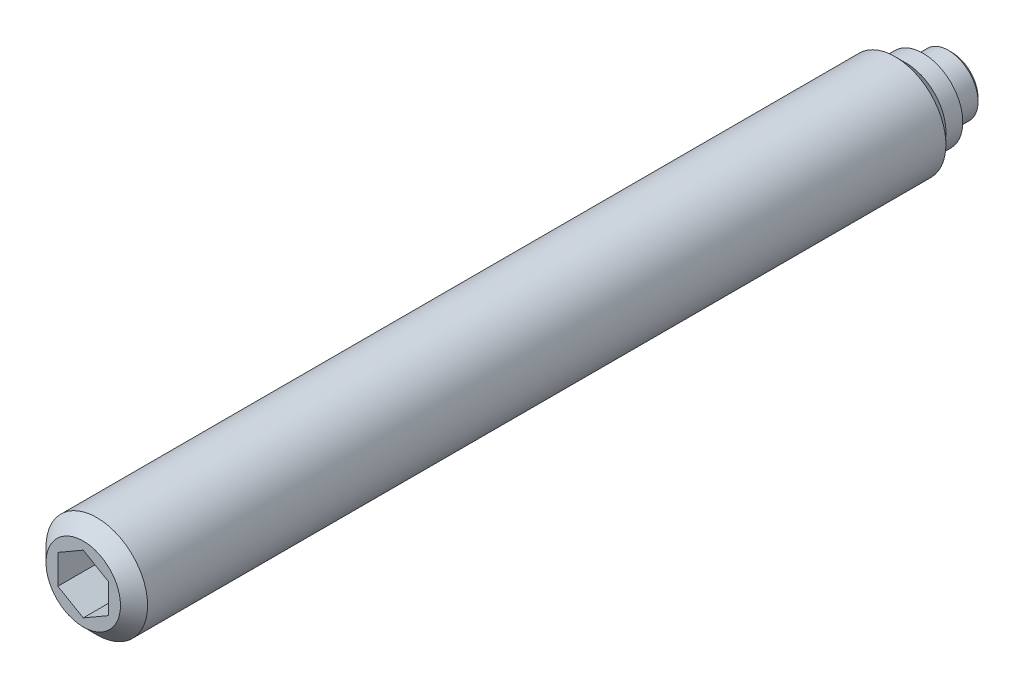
ISO-10303-21;
HEADER;
FILE_DESCRIPTION(('STEP AP214'),'2;1');
FILE_NAME('part.step','',(''),(''),'','','');
FILE_SCHEMA(('AUTOMOTIVE_DESIGN { 1 0 10303 214 1 1 1 1 }'));
ENDSEC;
DATA;
#1=APPLICATION_CONTEXT('core data for automotive mechanical design processes');
#2=APPLICATION_PROTOCOL_DEFINITION('international standard','automotive_design',2000,#1);
#3=PRODUCT_CONTEXT('',#1,'mechanical');
#4=PRODUCT('Part','Part','',(#3));
#5=PRODUCT_RELATED_PRODUCT_CATEGORY('part','',(#4));
#6=PRODUCT_DEFINITION_FORMATION('','',#4);
#7=PRODUCT_DEFINITION_CONTEXT('part definition',#1,'design');
#8=PRODUCT_DEFINITION('design','',#6,#7);
#9=PRODUCT_DEFINITION_SHAPE('','',#8);
#10=(LENGTH_UNIT() NAMED_UNIT(*) SI_UNIT(.MILLI.,.METRE.));
#11=(NAMED_UNIT(*) PLANE_ANGLE_UNIT() SI_UNIT($,.RADIAN.));
#12=(NAMED_UNIT(*) SI_UNIT($,.STERADIAN.) SOLID_ANGLE_UNIT());
#13=UNCERTAINTY_MEASURE_WITH_UNIT(LENGTH_MEASURE(1.E-05),#10,'distance_accuracy_value','');
#14=(GEOMETRIC_REPRESENTATION_CONTEXT(3) GLOBAL_UNCERTAINTY_ASSIGNED_CONTEXT((#13)) GLOBAL_UNIT_ASSIGNED_CONTEXT((#10,
#11,#12)) REPRESENTATION_CONTEXT('',''));
#15=CARTESIAN_POINT('',(0.,0.,0.));
#16=DIRECTION('',(0.,0.,1.));
#17=DIRECTION('',(1.,0.,0.));
#18=AXIS2_PLACEMENT_3D('',#15,#16,#17);
#19=CARTESIAN_POINT('',(0.,0.,0.));
#20=DIRECTION('',(0.,0.,-1.));
#21=DIRECTION('',(-1.,0.,0.));
#22=AXIS2_PLACEMENT_3D('',#19,#20,#21);
#23=CYLINDRICAL_SURFACE('',#22,1.75);
#24=CARTESIAN_POINT('',(0.,0.,0.2));
#25=DIRECTION('',(0.,0.,-1.));
#26=DIRECTION('',(-1.,0.,0.));
#27=AXIS2_PLACEMENT_3D('',#24,#25,#26);
#28=CIRCLE('',#27,1.75);
#29=CARTESIAN_POINT('',(-1.75,0.,0.2));
#30=VERTEX_POINT('',#29);
#31=EDGE_CURVE('E133',#30,#30,#28,.T.);
#32=ORIENTED_EDGE('',*,*,#31,.F.);
#33=EDGE_LOOP('',(#32));
#34=FACE_BOUND('',#33,.T.);
#35=CARTESIAN_POINT('',(0.,0.,1.7));
#36=DIRECTION('',(0.,0.,-1.));
#37=DIRECTION('',(-1.,0.,0.));
#38=AXIS2_PLACEMENT_3D('',#35,#36,#37);
#39=CIRCLE('',#38,1.75);
#40=CARTESIAN_POINT('',(-1.75,0.,1.7));
#41=VERTEX_POINT('',#40);
#42=EDGE_CURVE('E127',#41,#41,#39,.T.);
#43=ORIENTED_EDGE('',*,*,#42,.T.);
#44=EDGE_LOOP('',(#43));
#45=FACE_BOUND('',#44,.T.);
#46=ADVANCED_FACE('F14',(#34,#45),#23,.T.);
#47=CARTESIAN_POINT('',(0.,0.,0.2));
#48=DIRECTION('',(0.,0.,1.));
#49=DIRECTION('',(1.,0.,0.));
#50=AXIS2_PLACEMENT_3D('',#47,#48,#49);
#51=CONICAL_SURFACE('',#50,1.75,0.785398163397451);
#52=CARTESIAN_POINT('',(0.,0.,0.));
#53=DIRECTION('',(0.,0.,-1.));
#54=DIRECTION('',(-1.,0.,0.));
#55=AXIS2_PLACEMENT_3D('',#52,#53,#54);
#56=CIRCLE('',#55,1.55);
#57=CARTESIAN_POINT('',(-1.55,0.,0.));
#58=VERTEX_POINT('',#57);
#59=EDGE_CURVE('E130',#58,#58,#56,.T.);
#60=ORIENTED_EDGE('',*,*,#59,.F.);
#61=EDGE_LOOP('',(#60));
#62=FACE_BOUND('',#61,.T.);
#63=ORIENTED_EDGE('',*,*,#31,.T.);
#64=EDGE_LOOP('',(#63));
#65=FACE_BOUND('',#64,.T.);
#66=ADVANCED_FACE('F159',(#62,#65),#51,.T.);
#67=CARTESIAN_POINT('',(0.,1.55,0.));
#68=DIRECTION('',(0.,0.,1.));
#69=DIRECTION('',(1.,0.,0.));
#70=AXIS2_PLACEMENT_3D('',#67,#68,#69);
#71=PLANE('',#70);
#72=ORIENTED_EDGE('',*,*,#59,.T.);
#73=EDGE_LOOP('',(#72));
#74=FACE_BOUND('',#73,.T.);
#75=ADVANCED_FACE('F165',(#74),#71,.F.);
#76=CARTESIAN_POINT('',(0.,0.,1.7));
#77=DIRECTION('',(0.,0.,-1.));
#78=DIRECTION('',(-1.,0.,0.));
#79=AXIS2_PLACEMENT_3D('',#76,#77,#78);
#80=CYLINDRICAL_SURFACE('',#79,3.);
#81=CARTESIAN_POINT('',(0.,0.,3.35));
#82=DIRECTION('',(0.,0.,-1.));
#83=DIRECTION('',(-1.,0.,0.));
#84=AXIS2_PLACEMENT_3D('',#81,#82,#83);
#85=CIRCLE('',#84,3.);
#86=CARTESIAN_POINT('',(-3.,0.,3.35));
#87=VERTEX_POINT('',#86);
#88=EDGE_CURVE('E9',#87,#87,#85,.T.);
#89=ORIENTED_EDGE('',*,*,#88,.F.);
#90=EDGE_LOOP('',(#89));
#91=FACE_BOUND('',#90,.T.);
#92=CARTESIAN_POINT('',(0.,0.,50.5));
#93=DIRECTION('',(0.,0.,1.));
#94=DIRECTION('',(1.,0.,0.));
#95=AXIS2_PLACEMENT_3D('',#92,#93,#94);
#96=CIRCLE('',#95,3.);
#97=CARTESIAN_POINT('',(3.,0.,50.5));
#98=VERTEX_POINT('',#97);
#99=EDGE_CURVE('E124',#98,#98,#96,.T.);
#100=ORIENTED_EDGE('',*,*,#99,.F.);
#101=EDGE_LOOP('',(#100));
#102=FACE_BOUND('',#101,.T.);
#103=ADVANCED_FACE('F16',(#91,#102),#80,.T.);
#104=CARTESIAN_POINT('',(0.,2.35,1.7));
#105=DIRECTION('',(0.,0.,1.));
#106=DIRECTION('',(1.,0.,0.));
#107=AXIS2_PLACEMENT_3D('',#104,#105,#106);
#108=PLANE('',#107);
#109=CARTESIAN_POINT('',(0.,0.,1.7));
#110=DIRECTION('',(0.,0.,-1.));
#111=DIRECTION('',(-1.,0.,0.));
#112=AXIS2_PLACEMENT_3D('',#109,#110,#111);
#113=CIRCLE('',#112,2.35);
#114=CARTESIAN_POINT('',(-2.35,0.,1.7));
#115=VERTEX_POINT('',#114);
#116=EDGE_CURVE('E136',#115,#115,#113,.T.);
#117=ORIENTED_EDGE('',*,*,#116,.T.);
#118=EDGE_LOOP('',(#117));
#119=FACE_BOUND('',#118,.T.);
#120=ORIENTED_EDGE('',*,*,#42,.F.);
#121=EDGE_LOOP('',(#120));
#122=FACE_BOUND('',#121,.T.);
#123=ADVANCED_FACE('F156',(#119,#122),#108,.F.);
#124=CARTESIAN_POINT('',(0.,0.,1.7));
#125=DIRECTION('',(0.,0.,-1.));
#126=DIRECTION('',(-1.,0.,0.));
#127=AXIS2_PLACEMENT_3D('',#124,#125,#126);
#128=CYLINDRICAL_SURFACE('',#127,2.35);
#129=CARTESIAN_POINT('',(0.,0.,2.7));
#130=DIRECTION('',(0.,0.,-1.));
#131=DIRECTION('',(-1.,0.,0.));
#132=AXIS2_PLACEMENT_3D('',#129,#130,#131);
#133=CIRCLE('',#132,2.35);
#134=CARTESIAN_POINT('',(-2.35,0.,2.7));
#135=VERTEX_POINT('',#134);
#136=EDGE_CURVE('E22',#135,#135,#133,.T.);
#137=ORIENTED_EDGE('',*,*,#136,.T.);
#138=EDGE_LOOP('',(#137));
#139=FACE_BOUND('',#138,.T.);
#140=ORIENTED_EDGE('',*,*,#116,.F.);
#141=EDGE_LOOP('',(#140));
#142=FACE_BOUND('',#141,.T.);
#143=ADVANCED_FACE('F141',(#139,#142),#128,.T.);
#144=CARTESIAN_POINT('',(0.,0.,3.35));
#145=DIRECTION('',(0.,0.,1.));
#146=DIRECTION('',(1.,0.,0.));
#147=AXIS2_PLACEMENT_3D('',#144,#145,#146);
#148=CONICAL_SURFACE('',#147,3.,0.785398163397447);
#149=ORIENTED_EDGE('',*,*,#88,.T.);
#150=EDGE_LOOP('',(#149));
#151=FACE_BOUND('',#150,.T.);
#152=ORIENTED_EDGE('',*,*,#136,.F.);
#153=EDGE_LOOP('',(#152));
#154=FACE_BOUND('',#153,.T.);
#155=ADVANCED_FACE('F144',(#151,#154),#148,.T.);
#156=CARTESIAN_POINT('',(0.,-2.2,51.3));
#157=DIRECTION('',(0.,0.,1.));
#158=DIRECTION('',(1.,0.,0.));
#159=AXIS2_PLACEMENT_3D('',#156,#157,#158);
#160=PLANE('',#159);
#161=DIRECTION('',(0.866025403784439,-0.5,0.));
#162=VECTOR('',#161,1.);
#163=CARTESIAN_POINT('',(-1.5,-0.866025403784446,51.3));
#164=LINE('',#163,#162);
#165=CARTESIAN_POINT('',(-1.5,-0.866025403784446,51.3));
#166=VERTEX_POINT('',#165);
#167=CARTESIAN_POINT('',(0.,-1.73205080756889,51.3));
#168=VERTEX_POINT('',#167);
#169=EDGE_CURVE('E29',#166,#168,#164,.T.);
#170=ORIENTED_EDGE('',*,*,#169,.F.);
#171=DIRECTION('',(0.,-1.,0.));
#172=VECTOR('',#171,1.);
#173=CARTESIAN_POINT('',(-1.5,0.866025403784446,51.3));
#174=LINE('',#173,#172);
#175=CARTESIAN_POINT('',(-1.5,0.866025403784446,51.3));
#176=VERTEX_POINT('',#175);
#177=EDGE_CURVE('E112',#176,#166,#174,.T.);
#178=ORIENTED_EDGE('',*,*,#177,.F.);
#179=DIRECTION('',(-0.866025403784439,-0.5,0.));
#180=VECTOR('',#179,1.);
#181=CARTESIAN_POINT('',(0.,1.73205080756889,51.3));
#182=LINE('',#181,#180);
#183=CARTESIAN_POINT('',(0.,1.73205080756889,51.3));
#184=VERTEX_POINT('',#183);
#185=EDGE_CURVE('E110',#184,#176,#182,.T.);
#186=ORIENTED_EDGE('',*,*,#185,.F.);
#187=DIRECTION('',(-0.866025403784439,0.5,0.));
#188=VECTOR('',#187,1.);
#189=CARTESIAN_POINT('',(1.5,0.866025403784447,51.3));
#190=LINE('',#189,#188);
#191=CARTESIAN_POINT('',(1.5,0.866025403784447,51.3));
#192=VERTEX_POINT('',#191);
#193=EDGE_CURVE('E77',#192,#184,#190,.T.);
#194=ORIENTED_EDGE('',*,*,#193,.F.);
#195=DIRECTION('',(0.,1.,0.));
#196=VECTOR('',#195,1.);
#197=CARTESIAN_POINT('',(1.5,-0.866025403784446,51.3));
#198=LINE('',#197,#196);
#199=CARTESIAN_POINT('',(1.5,-0.866025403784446,51.3));
#200=VERTEX_POINT('',#199);
#201=EDGE_CURVE('E106',#200,#192,#198,.T.);
#202=ORIENTED_EDGE('',*,*,#201,.F.);
#203=DIRECTION('',(0.866025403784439,0.5,0.));
#204=VECTOR('',#203,1.);
#205=CARTESIAN_POINT('',(0.,-1.73205080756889,51.3));
#206=LINE('',#205,#204);
#207=EDGE_CURVE('E103',#168,#200,#206,.T.);
#208=ORIENTED_EDGE('',*,*,#207,.F.);
#209=EDGE_LOOP('',(#170,#178,#186,#194,#202,#208));
#210=FACE_BOUND('',#209,.T.);
#211=CARTESIAN_POINT('',(0.,0.,51.3));
#212=DIRECTION('',(0.,0.,1.));
#213=DIRECTION('',(1.,0.,0.));
#214=AXIS2_PLACEMENT_3D('',#211,#212,#213);
#215=CIRCLE('',#214,2.2);
#216=CARTESIAN_POINT('',(2.2,0.,51.3));
#217=VERTEX_POINT('',#216);
#218=EDGE_CURVE('E116',#217,#217,#215,.T.);
#219=ORIENTED_EDGE('',*,*,#218,.T.);
#220=EDGE_LOOP('',(#219));
#221=FACE_BOUND('',#220,.T.);
#222=ADVANCED_FACE('F146',(#210,#221),#160,.T.);
#223=CARTESIAN_POINT('',(0.,0.,51.3));
#224=DIRECTION('',(0.,0.,-1.));
#225=DIRECTION('',(-1.,0.,0.));
#226=AXIS2_PLACEMENT_3D('',#223,#224,#225);
#227=CONICAL_SURFACE('',#226,2.2,0.785398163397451);
#228=ORIENTED_EDGE('',*,*,#99,.T.);
#229=EDGE_LOOP('',(#228));
#230=FACE_BOUND('',#229,.T.);
#231=ORIENTED_EDGE('',*,*,#218,.F.);
#232=EDGE_LOOP('',(#231));
#233=FACE_BOUND('',#232,.T.);
#234=ADVANCED_FACE('F153',(#230,#233),#227,.T.);
#235=CARTESIAN_POINT('',(-1.5,-0.866025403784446,47.8));
#236=DIRECTION('',(-0.5,-0.866025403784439,0.));
#237=DIRECTION('',(0.866025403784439,-0.5,0.));
#238=AXIS2_PLACEMENT_3D('',#235,#236,#237);
#239=PLANE('',#238);
#240=ORIENTED_EDGE('',*,*,#169,.T.);
#241=DIRECTION('',(0.,0.,1.));
#242=VECTOR('',#241,1.);
#243=CARTESIAN_POINT('',(0.,-1.73205080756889,47.8));
#244=LINE('',#243,#242);
#245=CARTESIAN_POINT('',(0.,-1.73205080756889,47.8));
#246=VERTEX_POINT('',#245);
#247=EDGE_CURVE('E59',#246,#168,#244,.T.);
#248=ORIENTED_EDGE('',*,*,#247,.F.);
#249=DIRECTION('',(0.866025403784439,-0.5,0.));
#250=VECTOR('',#249,1.);
#251=CARTESIAN_POINT('',(-1.5,-0.866025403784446,47.8));
#252=LINE('',#251,#250);
#253=CARTESIAN_POINT('',(-1.5,-0.866025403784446,47.8));
#254=VERTEX_POINT('',#253);
#255=EDGE_CURVE('E114',#254,#246,#252,.T.);
#256=ORIENTED_EDGE('',*,*,#255,.F.);
#257=DIRECTION('',(0.,0.,1.));
#258=VECTOR('',#257,1.);
#259=CARTESIAN_POINT('',(-1.5,-0.866025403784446,47.8));
#260=LINE('',#259,#258);
#261=EDGE_CURVE('E37',#254,#166,#260,.T.);
#262=ORIENTED_EDGE('',*,*,#261,.T.);
#263=EDGE_LOOP('',(#240,#248,#256,#262));
#264=FACE_BOUND('',#263,.T.);
#265=ADVANCED_FACE('F191',(#264),#239,.F.);
#266=CARTESIAN_POINT('',(-1.5,0.866025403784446,47.8));
#267=DIRECTION('',(-1.,0.,0.));
#268=DIRECTION('',(0.,0.,1.));
#269=AXIS2_PLACEMENT_3D('',#266,#267,#268);
#270=PLANE('',#269);
#271=ORIENTED_EDGE('',*,*,#177,.T.);
#272=ORIENTED_EDGE('',*,*,#261,.F.);
#273=DIRECTION('',(0.,-1.,0.));
#274=VECTOR('',#273,1.);
#275=CARTESIAN_POINT('',(-1.5,0.866025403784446,47.8));
#276=LINE('',#275,#274);
#277=CARTESIAN_POINT('',(-1.5,0.866025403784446,47.8));
#278=VERTEX_POINT('',#277);
#279=EDGE_CURVE('E89',#278,#254,#276,.T.);
#280=ORIENTED_EDGE('',*,*,#279,.F.);
#281=DIRECTION('',(0.,0.,1.));
#282=VECTOR('',#281,1.);
#283=CARTESIAN_POINT('',(-1.5,0.866025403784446,47.8));
#284=LINE('',#283,#282);
#285=EDGE_CURVE('E81',#278,#176,#284,.T.);
#286=ORIENTED_EDGE('',*,*,#285,.T.);
#287=EDGE_LOOP('',(#271,#272,#280,#286));
#288=FACE_BOUND('',#287,.T.);
#289=ADVANCED_FACE('F198',(#288),#270,.F.);
#290=CARTESIAN_POINT('',(0.,1.73205080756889,47.8));
#291=DIRECTION('',(-0.5,0.866025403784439,0.));
#292=DIRECTION('',(-0.866025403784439,-0.5,0.));
#293=AXIS2_PLACEMENT_3D('',#290,#291,#292);
#294=PLANE('',#293);
#295=ORIENTED_EDGE('',*,*,#185,.T.);
#296=ORIENTED_EDGE('',*,*,#285,.F.);
#297=DIRECTION('',(-0.866025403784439,-0.5,0.));
#298=VECTOR('',#297,1.);
#299=CARTESIAN_POINT('',(0.,1.73205080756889,47.8));
#300=LINE('',#299,#298);
#301=CARTESIAN_POINT('',(0.,1.73205080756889,47.8));
#302=VERTEX_POINT('',#301);
#303=EDGE_CURVE('E85',#302,#278,#300,.T.);
#304=ORIENTED_EDGE('',*,*,#303,.F.);
#305=DIRECTION('',(0.,0.,1.));
#306=VECTOR('',#305,1.);
#307=CARTESIAN_POINT('',(0.,1.73205080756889,47.8));
#308=LINE('',#307,#306);
#309=EDGE_CURVE('E70',#302,#184,#308,.T.);
#310=ORIENTED_EDGE('',*,*,#309,.T.);
#311=EDGE_LOOP('',(#295,#296,#304,#310));
#312=FACE_BOUND('',#311,.T.);
#313=ADVANCED_FACE('F86',(#312),#294,.F.);
#314=CARTESIAN_POINT('',(1.5,0.866025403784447,47.8));
#315=DIRECTION('',(0.5,0.866025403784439,0.));
#316=DIRECTION('',(-0.866025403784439,0.5,0.));
#317=AXIS2_PLACEMENT_3D('',#314,#315,#316);
#318=PLANE('',#317);
#319=ORIENTED_EDGE('',*,*,#193,.T.);
#320=ORIENTED_EDGE('',*,*,#309,.F.);
#321=DIRECTION('',(-0.866025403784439,0.5,0.));
#322=VECTOR('',#321,1.);
#323=CARTESIAN_POINT('',(1.5,0.866025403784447,47.8));
#324=LINE('',#323,#322);
#325=CARTESIAN_POINT('',(1.5,0.866025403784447,47.8));
#326=VERTEX_POINT('',#325);
#327=EDGE_CURVE('E74',#326,#302,#324,.T.);
#328=ORIENTED_EDGE('',*,*,#327,.F.);
#329=DIRECTION('',(0.,0.,1.));
#330=VECTOR('',#329,1.);
#331=CARTESIAN_POINT('',(1.5,0.866025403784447,47.8));
#332=LINE('',#331,#330);
#333=EDGE_CURVE('E82',#326,#192,#332,.T.);
#334=ORIENTED_EDGE('',*,*,#333,.T.);
#335=EDGE_LOOP('',(#319,#320,#328,#334));
#336=FACE_BOUND('',#335,.T.);
#337=ADVANCED_FACE('F72',(#336),#318,.F.);
#338=CARTESIAN_POINT('',(1.5,-0.866025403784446,47.8));
#339=DIRECTION('',(1.,0.,0.));
#340=DIRECTION('',(0.,1.,0.));
#341=AXIS2_PLACEMENT_3D('',#338,#339,#340);
#342=PLANE('',#341);
#343=ORIENTED_EDGE('',*,*,#201,.T.);
#344=ORIENTED_EDGE('',*,*,#333,.F.);
#345=DIRECTION('',(0.,1.,0.));
#346=VECTOR('',#345,1.);
#347=CARTESIAN_POINT('',(1.5,-0.866025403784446,47.8));
#348=LINE('',#347,#346);
#349=CARTESIAN_POINT('',(1.5,-0.866025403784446,47.8));
#350=VERTEX_POINT('',#349);
#351=EDGE_CURVE('E95',#350,#326,#348,.T.);
#352=ORIENTED_EDGE('',*,*,#351,.F.);
#353=DIRECTION('',(0.,0.,1.));
#354=VECTOR('',#353,1.);
#355=CARTESIAN_POINT('',(1.5,-0.866025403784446,47.8));
#356=LINE('',#355,#354);
#357=EDGE_CURVE('E119',#350,#200,#356,.T.);
#358=ORIENTED_EDGE('',*,*,#357,.T.);
#359=EDGE_LOOP('',(#343,#344,#352,#358));
#360=FACE_BOUND('',#359,.T.);
#361=ADVANCED_FACE('F204',(#360),#342,.F.);
#362=CARTESIAN_POINT('',(0.,-1.73205080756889,47.8));
#363=DIRECTION('',(0.5,-0.866025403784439,0.));
#364=DIRECTION('',(0.866025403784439,0.5,0.));
#365=AXIS2_PLACEMENT_3D('',#362,#363,#364);
#366=PLANE('',#365);
#367=ORIENTED_EDGE('',*,*,#207,.T.);
#368=ORIENTED_EDGE('',*,*,#357,.F.);
#369=DIRECTION('',(0.866025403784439,0.5,0.));
#370=VECTOR('',#369,1.);
#371=CARTESIAN_POINT('',(0.,-1.73205080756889,47.8));
#372=LINE('',#371,#370);
#373=EDGE_CURVE('E97',#246,#350,#372,.T.);
#374=ORIENTED_EDGE('',*,*,#373,.F.);
#375=ORIENTED_EDGE('',*,*,#247,.T.);
#376=EDGE_LOOP('',(#367,#368,#374,#375));
#377=FACE_BOUND('',#376,.T.);
#378=ADVANCED_FACE('F201',(#377),#366,.F.);
#379=CARTESIAN_POINT('',(0.,0.,47.8));
#380=DIRECTION('',(0.,0.,1.));
#381=DIRECTION('',(1.,0.,0.));
#382=AXIS2_PLACEMENT_3D('',#379,#380,#381);
#383=PLANE('',#382);
#384=ORIENTED_EDGE('',*,*,#255,.T.);
#385=ORIENTED_EDGE('',*,*,#373,.T.);
#386=ORIENTED_EDGE('',*,*,#351,.T.);
#387=ORIENTED_EDGE('',*,*,#327,.T.);
#388=ORIENTED_EDGE('',*,*,#303,.T.);
#389=ORIENTED_EDGE('',*,*,#279,.T.);
#390=EDGE_LOOP('',(#384,#385,#386,#387,#388,#389));
#391=FACE_BOUND('',#390,.T.);
#392=ADVANCED_FACE('F92',(#391),#383,.T.);
#393=CLOSED_SHELL('',(#46,#66,#75,#103,#123,#143,#155,#222,#234,#265,#289,#313,#337,#361,#378,#392));
#394=MANIFOLD_SOLID_BREP('B1',#393);
#395=ADVANCED_BREP_SHAPE_REPRESENTATION('',(#18,#394),#14);
#396=SHAPE_DEFINITION_REPRESENTATION(#9,#395);
ENDSEC;
END-ISO-10303-21;
